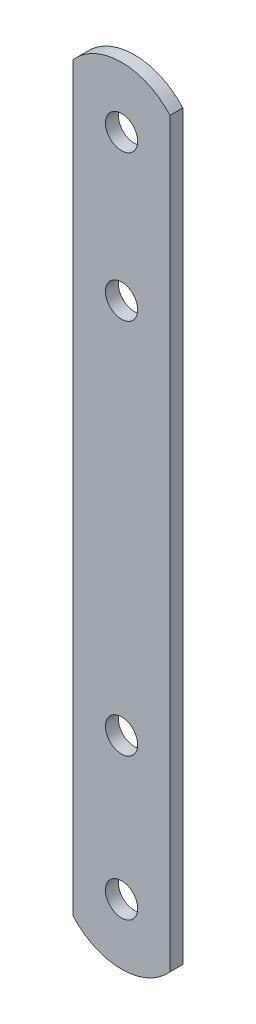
from build123d import *

# Parameters (mm, degrees)
ESQUISSE1_W      = 15
ESQUISSE1_H      = 115
ESQUISSE1_R      = 2.5
EXTRUSION1_DEPTH = 2


with BuildPart() as part:
    # Esquisse1 → Extrusion1 (new body)
    # profile 1 of 3: a face of its own
    with BuildSketch(Plane.XY):
        with BuildLine():
            ThreePointArc((7.5, -57.5), (0, -60.885621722), (-7.5, -57.5))
            Line((-7.5, -57.5), (7.5, -57.5))
        make_face()
    # profile 2 of 3: a face of its own
    with BuildSketch(Plane.XY):
        Rectangle(ESQUISSE1_W, ESQUISSE1_H)
        with Locations((0, -51.5)):
            Circle(ESQUISSE1_R, mode=Mode.SUBTRACT)
        with Locations((0, -29.5)):
            Circle(ESQUISSE1_R, mode=Mode.SUBTRACT)
        with Locations((0, 28.885621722)):
            Circle(ESQUISSE1_R, mode=Mode.SUBTRACT)
        with Locations((0, 51.5)):
            Circle(ESQUISSE1_R, mode=Mode.SUBTRACT)
    # profile 3 of 3: a face of its own
    with BuildSketch(Plane.XY):
        with BuildLine():
            Line((7.5, 57.5), (-7.5, 57.5))
            ThreePointArc((-7.5, 57.5), (0, 60.885621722), (7.5, 57.5))
        make_face()
    extrude(amount=-EXTRUSION1_DEPTH)


solid = part.part
